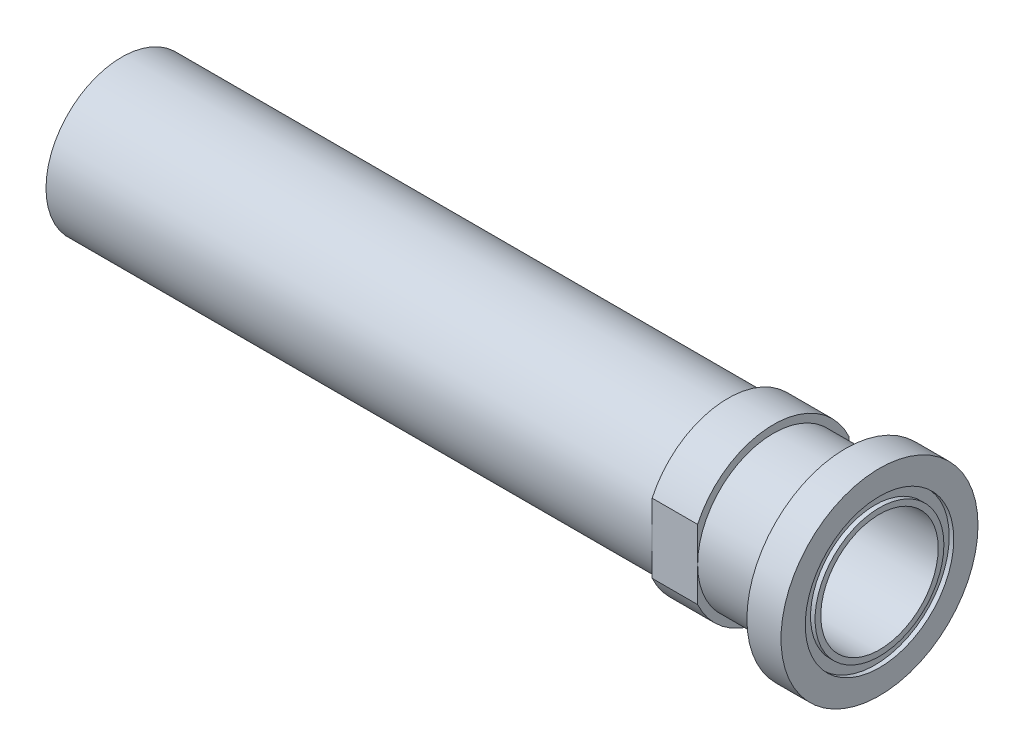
ISO-10303-21;
HEADER;
FILE_DESCRIPTION(('STEP AP214'),'2;1');
FILE_NAME('part.step','',(''),(''),'','','');
FILE_SCHEMA(('AUTOMOTIVE_DESIGN { 1 0 10303 214 1 1 1 1 }'));
ENDSEC;
DATA;
#1=APPLICATION_CONTEXT('core data for automotive mechanical design processes');
#2=APPLICATION_PROTOCOL_DEFINITION('international standard','automotive_design',2000,#1);
#3=PRODUCT_CONTEXT('',#1,'mechanical');
#4=PRODUCT('Part','Part','',(#3));
#5=PRODUCT_RELATED_PRODUCT_CATEGORY('part','',(#4));
#6=PRODUCT_DEFINITION_FORMATION('','',#4);
#7=PRODUCT_DEFINITION_CONTEXT('part definition',#1,'design');
#8=PRODUCT_DEFINITION('design','',#6,#7);
#9=PRODUCT_DEFINITION_SHAPE('','',#8);
#10=(LENGTH_UNIT() NAMED_UNIT(*) SI_UNIT(.MILLI.,.METRE.));
#11=(NAMED_UNIT(*) PLANE_ANGLE_UNIT() SI_UNIT($,.RADIAN.));
#12=(NAMED_UNIT(*) SI_UNIT($,.STERADIAN.) SOLID_ANGLE_UNIT());
#13=UNCERTAINTY_MEASURE_WITH_UNIT(LENGTH_MEASURE(1.E-05),#10,'distance_accuracy_value','');
#14=(GEOMETRIC_REPRESENTATION_CONTEXT(3) GLOBAL_UNCERTAINTY_ASSIGNED_CONTEXT((#13)) GLOBAL_UNIT_ASSIGNED_CONTEXT((#10,
#11,#12)) REPRESENTATION_CONTEXT('',''));
#15=CARTESIAN_POINT('',(0.,0.,0.));
#16=DIRECTION('',(0.,0.,1.));
#17=DIRECTION('',(1.,0.,0.));
#18=AXIS2_PLACEMENT_3D('',#15,#16,#17);
#19=CARTESIAN_POINT('',(-983.,0.,0.));
#20=DIRECTION('',(-1.,0.,0.));
#21=DIRECTION('',(0.,0.,1.));
#22=AXIS2_PLACEMENT_3D('',#19,#20,#21);
#23=CYLINDRICAL_SURFACE('',#22,6.);
#24=CARTESIAN_POINT('',(-988.,0.,0.));
#25=DIRECTION('',(-1.,0.,0.));
#26=DIRECTION('',(0.,0.,1.));
#27=AXIS2_PLACEMENT_3D('',#24,#25,#26);
#28=CIRCLE('',#27,6.);
#29=CARTESIAN_POINT('',(-988.,0.,6.));
#30=VERTEX_POINT('',#29);
#31=EDGE_CURVE('E45',#30,#30,#28,.T.);
#32=ORIENTED_EDGE('',*,*,#31,.T.);
#33=EDGE_LOOP('',(#32));
#34=FACE_BOUND('',#33,.T.);
#35=CARTESIAN_POINT('',(-997.5,0.,0.));
#36=DIRECTION('',(-1.,0.,0.));
#37=DIRECTION('',(0.,0.,1.));
#38=AXIS2_PLACEMENT_3D('',#35,#36,#37);
#39=CIRCLE('',#38,6.);
#40=CARTESIAN_POINT('',(-997.5,0.,6.));
#41=VERTEX_POINT('',#40);
#42=EDGE_CURVE('E480',#41,#41,#39,.T.);
#43=ORIENTED_EDGE('',*,*,#42,.F.);
#44=EDGE_LOOP('',(#43));
#45=FACE_BOUND('',#44,.T.);
#46=ADVANCED_FACE('F37',(#34,#45),#23,.T.);
#47=CARTESIAN_POINT('',(-998.,0.,0.));
#48=DIRECTION('',(-1.,0.,0.));
#49=DIRECTION('',(0.,0.,1.));
#50=AXIS2_PLACEMENT_3D('',#47,#48,#49);
#51=PLANE('',#50);
#52=CARTESIAN_POINT('',(-998.,0.,0.));
#53=DIRECTION('',(-1.,0.,0.));
#54=DIRECTION('',(0.,0.,1.));
#55=AXIS2_PLACEMENT_3D('',#52,#53,#54);
#56=CIRCLE('',#55,4.20000000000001);
#57=CARTESIAN_POINT('',(-998.,0.,4.20000000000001));
#58=VERTEX_POINT('',#57);
#59=EDGE_CURVE('E488',#58,#58,#56,.T.);
#60=ORIENTED_EDGE('',*,*,#59,.F.);
#61=EDGE_LOOP('',(#60));
#62=FACE_BOUND('',#61,.T.);
#63=CARTESIAN_POINT('',(-998.,0.,0.));
#64=DIRECTION('',(-1.,0.,0.));
#65=DIRECTION('',(0.,0.,1.));
#66=AXIS2_PLACEMENT_3D('',#63,#64,#65);
#67=CIRCLE('',#66,4.8);
#68=CARTESIAN_POINT('',(-998.,0.,4.8));
#69=VERTEX_POINT('',#68);
#70=EDGE_CURVE('E477',#69,#69,#67,.T.);
#71=ORIENTED_EDGE('',*,*,#70,.T.);
#72=EDGE_LOOP('',(#71));
#73=FACE_BOUND('',#72,.T.);
#74=ADVANCED_FACE('F185',(#62,#73),#51,.T.);
#75=CARTESIAN_POINT('',(-900.,0.,0.));
#76=DIRECTION('',(-1.,0.,0.));
#77=DIRECTION('',(0.,0.,1.));
#78=AXIS2_PLACEMENT_3D('',#75,#76,#77);
#79=CYLINDRICAL_SURFACE('',#78,2.5);
#80=CARTESIAN_POINT('',(-900.,0.,0.));
#81=DIRECTION('',(-1.,0.,0.));
#82=DIRECTION('',(0.,0.,1.));
#83=AXIS2_PLACEMENT_3D('',#80,#81,#82);
#84=CIRCLE('',#83,2.5);
#85=CARTESIAN_POINT('',(-900.,0.,2.5));
#86=VERTEX_POINT('',#85);
#87=EDGE_CURVE('E287',#86,#86,#84,.T.);
#88=ORIENTED_EDGE('',*,*,#87,.F.);
#89=EDGE_LOOP('',(#88));
#90=FACE_BOUND('',#89,.T.);
#91=CARTESIAN_POINT('',(-992.,0.,0.));
#92=DIRECTION('',(-1.,0.,0.));
#93=DIRECTION('',(0.,0.,1.));
#94=AXIS2_PLACEMENT_3D('',#91,#92,#93);
#95=CIRCLE('',#94,2.5);
#96=CARTESIAN_POINT('',(-992.,0.,2.5));
#97=VERTEX_POINT('',#96);
#98=EDGE_CURVE('E160',#97,#97,#95,.F.);
#99=ORIENTED_EDGE('',*,*,#98,.F.);
#100=EDGE_LOOP('',(#99));
#101=FACE_BOUND('',#100,.T.);
#102=ADVANCED_FACE('F190',(#90,#101),#79,.F.);
#103=CARTESIAN_POINT('',(-140.,0.,-100.));
#104=DIRECTION('',(-1.,0.,0.));
#105=DIRECTION('',(0.,0.,1.));
#106=AXIS2_PLACEMENT_3D('',#103,#104,#105);
#107=PLANE('',#106);
#108=CARTESIAN_POINT('',(-140.,0.,0.));
#109=DIRECTION('',(1.,0.,0.));
#110=DIRECTION('',(0.,0.,-1.));
#111=AXIS2_PLACEMENT_3D('',#108,#109,#110);
#112=CIRCLE('',#111,110.);
#113=CARTESIAN_POINT('',(-140.,-45.8257569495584,100.));
#114=VERTEX_POINT('',#113);
#115=CARTESIAN_POINT('',(-140.,-45.8257569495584,-100.));
#116=VERTEX_POINT('',#115);
#117=EDGE_CURVE('E110',#114,#116,#112,.T.);
#118=ORIENTED_EDGE('',*,*,#117,.T.);
#119=DIRECTION('',(0.,-1.,0.));
#120=VECTOR('',#119,1.);
#121=CARTESIAN_POINT('',(-140.,-83.0662386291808,-100.));
#122=LINE('',#121,#120);
#123=CARTESIAN_POINT('',(-140.,0.,-100.));
#124=VERTEX_POINT('',#123);
#125=EDGE_CURVE('E52',#124,#116,#122,.T.);
#126=ORIENTED_EDGE('',*,*,#125,.F.);
#127=CARTESIAN_POINT('',(-140.,0.,0.));
#128=DIRECTION('',(1.,0.,0.));
#129=DIRECTION('',(0.,0.,-1.));
#130=AXIS2_PLACEMENT_3D('',#127,#128,#129);
#131=CIRCLE('',#130,100.);
#132=CARTESIAN_POINT('',(-140.,0.,100.));
#133=VERTEX_POINT('',#132);
#134=EDGE_CURVE('E111',#133,#124,#131,.T.);
#135=ORIENTED_EDGE('',*,*,#134,.F.);
#136=DIRECTION('',(0.,1.,0.));
#137=VECTOR('',#136,1.);
#138=CARTESIAN_POINT('',(-140.,-83.0662386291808,100.));
#139=LINE('',#138,#137);
#140=EDGE_CURVE('E299',#114,#133,#139,.T.);
#141=ORIENTED_EDGE('',*,*,#140,.F.);
#142=EDGE_LOOP('',(#118,#126,#135,#141));
#143=FACE_BOUND('',#142,.T.);
#144=ADVANCED_FACE('F207',(#143),#107,.F.);
#145=CARTESIAN_POINT('',(-200.,0.,0.));
#146=DIRECTION('',(-1.,0.,0.));
#147=DIRECTION('',(0.,0.,1.));
#148=AXIS2_PLACEMENT_3D('',#145,#146,#147);
#149=PLANE('',#148);
#150=DIRECTION('',(0.,-1.,0.));
#151=VECTOR('',#150,1.);
#152=CARTESIAN_POINT('',(-200.,-83.0662386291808,-100.));
#153=LINE('',#152,#151);
#154=CARTESIAN_POINT('',(-200.,0.,-100.));
#155=VERTEX_POINT('',#154);
#156=CARTESIAN_POINT('',(-200.,-45.8257569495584,-100.));
#157=VERTEX_POINT('',#156);
#158=EDGE_CURVE('E105',#155,#157,#153,.T.);
#159=ORIENTED_EDGE('',*,*,#158,.T.);
#160=CARTESIAN_POINT('',(-200.,0.,0.));
#161=DIRECTION('',(-1.,0.,0.));
#162=DIRECTION('',(0.,0.,1.));
#163=AXIS2_PLACEMENT_3D('',#160,#161,#162);
#164=CIRCLE('',#163,110.);
#165=CARTESIAN_POINT('',(-200.,-45.8257569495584,100.));
#166=VERTEX_POINT('',#165);
#167=EDGE_CURVE('E121',#157,#166,#164,.T.);
#168=ORIENTED_EDGE('',*,*,#167,.T.);
#169=DIRECTION('',(0.,1.,0.));
#170=VECTOR('',#169,1.);
#171=CARTESIAN_POINT('',(-200.,-83.0662386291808,100.));
#172=LINE('',#171,#170);
#173=CARTESIAN_POINT('',(-200.,0.,100.));
#174=VERTEX_POINT('',#173);
#175=EDGE_CURVE('E298',#166,#174,#172,.T.);
#176=ORIENTED_EDGE('',*,*,#175,.T.);
#177=CARTESIAN_POINT('',(-200.,0.,0.));
#178=DIRECTION('',(-1.,0.,0.));
#179=DIRECTION('',(0.,0.,1.));
#180=AXIS2_PLACEMENT_3D('',#177,#178,#179);
#181=CIRCLE('',#180,100.);
#182=EDGE_CURVE('E122',#155,#174,#181,.T.);
#183=ORIENTED_EDGE('',*,*,#182,.F.);
#184=EDGE_LOOP('',(#159,#168,#176,#183));
#185=FACE_BOUND('',#184,.T.);
#186=ADVANCED_FACE('F241',(#185),#149,.T.);
#187=CARTESIAN_POINT('',(-45.,0.,0.));
#188=DIRECTION('',(-1.,0.,0.));
#189=DIRECTION('',(0.,0.,1.));
#190=AXIS2_PLACEMENT_3D('',#187,#188,#189);
#191=CYLINDRICAL_SURFACE('',#190,110.);
#192=DIRECTION('',(-1.,0.,0.));
#193=VECTOR('',#192,1.);
#194=CARTESIAN_POINT('',(-45.,45.8257569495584,-100.));
#195=LINE('',#194,#193);
#196=CARTESIAN_POINT('',(-200.,45.8257569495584,-100.));
#197=VERTEX_POINT('',#196);
#198=CARTESIAN_POINT('',(-140.,45.8257569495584,-100.));
#199=VERTEX_POINT('',#198);
#200=EDGE_CURVE('E90',#197,#199,#195,.F.);
#201=ORIENTED_EDGE('',*,*,#200,.F.);
#202=CARTESIAN_POINT('',(-200.,45.8257569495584,100.));
#203=VERTEX_POINT('',#202);
#204=EDGE_CURVE('E125',#203,#197,#164,.T.);
#205=ORIENTED_EDGE('',*,*,#204,.F.);
#206=DIRECTION('',(-1.,0.,0.));
#207=VECTOR('',#206,1.);
#208=CARTESIAN_POINT('',(-45.,45.8257569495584,100.));
#209=LINE('',#208,#207);
#210=CARTESIAN_POINT('',(-140.,45.8257569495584,100.));
#211=VERTEX_POINT('',#210);
#212=EDGE_CURVE('E109',#211,#203,#209,.T.);
#213=ORIENTED_EDGE('',*,*,#212,.F.);
#214=EDGE_CURVE('E60',#199,#211,#112,.T.);
#215=ORIENTED_EDGE('',*,*,#214,.F.);
#216=EDGE_LOOP('',(#201,#205,#213,#215));
#217=FACE_BOUND('',#216,.T.);
#218=ADVANCED_FACE('F108',(#217),#191,.T.);
#219=CARTESIAN_POINT('',(-1000.,0.,0.));
#220=DIRECTION('',(1.,0.,0.));
#221=DIRECTION('',(0.,0.,-1.));
#222=AXIS2_PLACEMENT_3D('',#219,#220,#221);
#223=CYLINDRICAL_SURFACE('',#222,130.);
#224=CARTESIAN_POINT('',(0.,0.,0.));
#225=DIRECTION('',(1.,0.,0.));
#226=DIRECTION('',(0.,0.,-1.));
#227=AXIS2_PLACEMENT_3D('',#224,#225,#226);
#228=CIRCLE('',#227,130.);
#229=CARTESIAN_POINT('',(0.,0.,-130.));
#230=VERTEX_POINT('',#229);
#231=EDGE_CURVE('E142',#230,#230,#228,.T.);
#232=ORIENTED_EDGE('',*,*,#231,.F.);
#233=EDGE_LOOP('',(#232));
#234=FACE_BOUND('',#233,.T.);
#235=CARTESIAN_POINT('',(-45.,0.,0.));
#236=DIRECTION('',(-1.,0.,0.));
#237=DIRECTION('',(0.,0.,1.));
#238=AXIS2_PLACEMENT_3D('',#235,#236,#237);
#239=CIRCLE('',#238,130.);
#240=CARTESIAN_POINT('',(-45.,0.,130.));
#241=VERTEX_POINT('',#240);
#242=EDGE_CURVE('E137',#241,#241,#239,.T.);
#243=ORIENTED_EDGE('',*,*,#242,.F.);
#244=EDGE_LOOP('',(#243));
#245=FACE_BOUND('',#244,.T.);
#246=ADVANCED_FACE('F267',(#234,#245),#223,.T.);
#247=CARTESIAN_POINT('',(0.,0.,0.));
#248=DIRECTION('',(1.,0.,0.));
#249=DIRECTION('',(0.,0.,-1.));
#250=AXIS2_PLACEMENT_3D('',#247,#248,#249);
#251=PLANE('',#250);
#252=CARTESIAN_POINT('',(0.,0.,0.));
#253=DIRECTION('',(1.,0.,0.));
#254=DIRECTION('',(0.,0.,-1.));
#255=AXIS2_PLACEMENT_3D('',#252,#253,#254);
#256=CIRCLE('',#255,98.);
#257=CARTESIAN_POINT('',(0.,0.,-98.));
#258=VERTEX_POINT('',#257);
#259=EDGE_CURVE('E131',#258,#258,#256,.T.);
#260=ORIENTED_EDGE('',*,*,#259,.F.);
#261=EDGE_LOOP('',(#260));
#262=FACE_BOUND('',#261,.T.);
#263=ORIENTED_EDGE('',*,*,#231,.T.);
#264=EDGE_LOOP('',(#263));
#265=FACE_BOUND('',#264,.T.);
#266=ADVANCED_FACE('F260',(#262,#265),#251,.T.);
#267=CARTESIAN_POINT('',(-45.,0.,0.));
#268=DIRECTION('',(-1.,0.,0.));
#269=DIRECTION('',(0.,0.,1.));
#270=AXIS2_PLACEMENT_3D('',#267,#268,#269);
#271=PLANE('',#270);
#272=CARTESIAN_POINT('',(-45.,0.,0.));
#273=DIRECTION('',(-1.,0.,0.));
#274=DIRECTION('',(0.,0.,1.));
#275=AXIS2_PLACEMENT_3D('',#272,#273,#274);
#276=CIRCLE('',#275,105.);
#277=CARTESIAN_POINT('',(-45.,0.,105.));
#278=VERTEX_POINT('',#277);
#279=EDGE_CURVE('E98',#278,#278,#276,.F.);
#280=ORIENTED_EDGE('',*,*,#279,.T.);
#281=EDGE_LOOP('',(#280));
#282=FACE_BOUND('',#281,.T.);
#283=ORIENTED_EDGE('',*,*,#242,.T.);
#284=EDGE_LOOP('',(#283));
#285=FACE_BOUND('',#284,.T.);
#286=ADVANCED_FACE('F253',(#282,#285),#271,.T.);
#287=CARTESIAN_POINT('',(-6.,0.,0.));
#288=DIRECTION('',(1.,0.,0.));
#289=DIRECTION('',(0.,0.,-1.));
#290=AXIS2_PLACEMENT_3D('',#287,#288,#289);
#291=CYLINDRICAL_SURFACE('',#290,98.);
#292=CARTESIAN_POINT('',(-6.,0.,0.));
#293=DIRECTION('',(1.,0.,0.));
#294=DIRECTION('',(0.,0.,-1.));
#295=AXIS2_PLACEMENT_3D('',#292,#293,#294);
#296=CIRCLE('',#295,98.);
#297=CARTESIAN_POINT('',(-6.,0.,-98.));
#298=VERTEX_POINT('',#297);
#299=EDGE_CURVE('E134',#298,#298,#296,.T.);
#300=ORIENTED_EDGE('',*,*,#299,.F.);
#301=EDGE_LOOP('',(#300));
#302=FACE_BOUND('',#301,.T.);
#303=ORIENTED_EDGE('',*,*,#259,.T.);
#304=EDGE_LOOP('',(#303));
#305=FACE_BOUND('',#304,.T.);
#306=ADVANCED_FACE('F249',(#302,#305),#291,.F.);
#307=CARTESIAN_POINT('',(-6.,0.,0.));
#308=DIRECTION('',(1.,0.,0.));
#309=DIRECTION('',(0.,0.,-1.));
#310=AXIS2_PLACEMENT_3D('',#307,#308,#309);
#311=PLANE('',#310);
#312=CARTESIAN_POINT('',(-6.,0.,0.));
#313=DIRECTION('',(1.,0.,0.));
#314=DIRECTION('',(0.,0.,-1.));
#315=AXIS2_PLACEMENT_3D('',#312,#313,#314);
#316=CIRCLE('',#315,85.);
#317=CARTESIAN_POINT('',(-6.,0.,-85.));
#318=VERTEX_POINT('',#317);
#319=EDGE_CURVE('E128',#318,#318,#316,.T.);
#320=ORIENTED_EDGE('',*,*,#319,.F.);
#321=EDGE_LOOP('',(#320));
#322=FACE_BOUND('',#321,.T.);
#323=ORIENTED_EDGE('',*,*,#299,.T.);
#324=EDGE_LOOP('',(#323));
#325=FACE_BOUND('',#324,.T.);
#326=ADVANCED_FACE('F245',(#322,#325),#311,.T.);
#327=CARTESIAN_POINT('',(-6.,0.,0.));
#328=DIRECTION('',(1.,0.,0.));
#329=DIRECTION('',(0.,0.,-1.));
#330=AXIS2_PLACEMENT_3D('',#327,#328,#329);
#331=CYLINDRICAL_SURFACE('',#330,85.);
#332=ORIENTED_EDGE('',*,*,#319,.T.);
#333=EDGE_LOOP('',(#332));
#334=FACE_BOUND('',#333,.T.);
#335=CARTESIAN_POINT('',(0.,0.,0.));
#336=DIRECTION('',(1.,0.,0.));
#337=DIRECTION('',(0.,0.,-1.));
#338=AXIS2_PLACEMENT_3D('',#335,#336,#337);
#339=CIRCLE('',#338,85.);
#340=CARTESIAN_POINT('',(0.,0.,-85.));
#341=VERTEX_POINT('',#340);
#342=EDGE_CURVE('E127',#341,#341,#339,.T.);
#343=ORIENTED_EDGE('',*,*,#342,.F.);
#344=EDGE_LOOP('',(#343));
#345=FACE_BOUND('',#344,.T.);
#346=ADVANCED_FACE('F242',(#334,#345),#331,.T.);
#347=CARTESIAN_POINT('',(0.,0.,0.));
#348=DIRECTION('',(1.,0.,0.));
#349=DIRECTION('',(0.,0.,-1.));
#350=AXIS2_PLACEMENT_3D('',#347,#348,#349);
#351=CIRCLE('',#350,77.5);
#352=CARTESIAN_POINT('',(0.,0.,-77.5));
#353=VERTEX_POINT('',#352);
#354=EDGE_CURVE('E285',#353,#353,#351,.T.);
#355=ORIENTED_EDGE('',*,*,#354,.F.);
#356=EDGE_LOOP('',(#355));
#357=FACE_BOUND('',#356,.T.);
#358=ORIENTED_EDGE('',*,*,#342,.T.);
#359=EDGE_LOOP('',(#358));
#360=FACE_BOUND('',#359,.T.);
#361=ADVANCED_FACE('F232',(#357,#360),#251,.T.);
#362=EDGE_CURVE('E103',#124,#133,#131,.T.);
#363=ORIENTED_EDGE('',*,*,#362,.F.);
#364=EDGE_CURVE('E92',#199,#124,#122,.T.);
#365=ORIENTED_EDGE('',*,*,#364,.F.);
#366=ORIENTED_EDGE('',*,*,#214,.T.);
#367=EDGE_CURVE('E300',#133,#211,#139,.T.);
#368=ORIENTED_EDGE('',*,*,#367,.F.);
#369=EDGE_LOOP('',(#363,#365,#366,#368));
#370=FACE_BOUND('',#369,.T.);
#371=ADVANCED_FACE('F102',(#370),#107,.F.);
#372=CARTESIAN_POINT('',(56.3397715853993,0.,0.));
#373=DIRECTION('',(1.,0.,0.));
#374=DIRECTION('',(0.,0.,-1.));
#375=AXIS2_PLACEMENT_3D('',#372,#373,#374);
#376=CYLINDRICAL_SURFACE('',#375,100.);
#377=CARTESIAN_POINT('',(-50.,0.,0.));
#378=DIRECTION('',(-1.,0.,0.));
#379=DIRECTION('',(0.,0.,1.));
#380=AXIS2_PLACEMENT_3D('',#377,#378,#379);
#381=CIRCLE('',#380,100.);
#382=CARTESIAN_POINT('',(-50.,0.,100.));
#383=VERTEX_POINT('',#382);
#384=EDGE_CURVE('E151',#383,#383,#381,.T.);
#385=ORIENTED_EDGE('',*,*,#384,.T.);
#386=EDGE_LOOP('',(#385));
#387=FACE_BOUND('',#386,.T.);
#388=ORIENTED_EDGE('',*,*,#134,.T.);
#389=ORIENTED_EDGE('',*,*,#362,.T.);
#390=EDGE_LOOP('',(#388,#389));
#391=FACE_BOUND('',#390,.T.);
#392=ADVANCED_FACE('F225',(#387,#391),#376,.T.);
#393=CARTESIAN_POINT('',(-1000.,0.,0.));
#394=DIRECTION('',(1.,0.,0.));
#395=DIRECTION('',(0.,0.,-1.));
#396=AXIS2_PLACEMENT_3D('',#393,#394,#395);
#397=PLANE('',#396);
#398=CARTESIAN_POINT('',(-1000.,0.,0.));
#399=DIRECTION('',(-1.,0.,0.));
#400=DIRECTION('',(0.,0.,1.));
#401=AXIS2_PLACEMENT_3D('',#398,#399,#400);
#402=CIRCLE('',#401,90.);
#403=CARTESIAN_POINT('',(-1000.,0.,90.));
#404=VERTEX_POINT('',#403);
#405=EDGE_CURVE('E162',#404,#404,#402,.T.);
#406=ORIENTED_EDGE('',*,*,#405,.F.);
#407=EDGE_LOOP('',(#406));
#408=FACE_BOUND('',#407,.T.);
#409=CARTESIAN_POINT('',(-1000.,0.,0.));
#410=DIRECTION('',(-1.,0.,0.));
#411=DIRECTION('',(0.,0.,1.));
#412=AXIS2_PLACEMENT_3D('',#409,#410,#411);
#413=CIRCLE('',#412,100.);
#414=CARTESIAN_POINT('',(-1000.,0.,100.));
#415=VERTEX_POINT('',#414);
#416=EDGE_CURVE('E114',#415,#415,#413,.T.);
#417=ORIENTED_EDGE('',*,*,#416,.T.);
#418=EDGE_LOOP('',(#417));
#419=FACE_BOUND('',#418,.T.);
#420=ADVANCED_FACE('F228',(#408,#419),#397,.F.);
#421=CARTESIAN_POINT('',(-200.,0.,0.));
#422=DIRECTION('',(-1.,0.,0.));
#423=DIRECTION('',(0.,0.,1.));
#424=AXIS2_PLACEMENT_3D('',#421,#422,#423);
#425=CYLINDRICAL_SURFACE('',#424,100.);
#426=EDGE_CURVE('E118',#174,#155,#181,.T.);
#427=ORIENTED_EDGE('',*,*,#426,.T.);
#428=ORIENTED_EDGE('',*,*,#182,.T.);
#429=EDGE_LOOP('',(#427,#428));
#430=FACE_BOUND('',#429,.T.);
#431=ORIENTED_EDGE('',*,*,#416,.F.);
#432=EDGE_LOOP('',(#431));
#433=FACE_BOUND('',#432,.T.);
#434=ADVANCED_FACE('F233',(#430,#433),#425,.T.);
#435=EDGE_CURVE('E94',#197,#155,#153,.T.);
#436=ORIENTED_EDGE('',*,*,#435,.T.);
#437=ORIENTED_EDGE('',*,*,#426,.F.);
#438=EDGE_CURVE('E296',#174,#203,#172,.T.);
#439=ORIENTED_EDGE('',*,*,#438,.T.);
#440=ORIENTED_EDGE('',*,*,#204,.T.);
#441=EDGE_LOOP('',(#436,#437,#439,#440));
#442=FACE_BOUND('',#441,.T.);
#443=ADVANCED_FACE('F236',(#442),#149,.T.);
#444=DIRECTION('',(-1.,0.,0.));
#445=VECTOR('',#444,1.);
#446=CARTESIAN_POINT('',(-45.,-45.8257569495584,-100.));
#447=LINE('',#446,#445);
#448=EDGE_CURVE('E99',#116,#157,#447,.T.);
#449=ORIENTED_EDGE('',*,*,#448,.F.);
#450=ORIENTED_EDGE('',*,*,#117,.F.);
#451=DIRECTION('',(-1.,0.,0.));
#452=VECTOR('',#451,1.);
#453=CARTESIAN_POINT('',(-45.,-45.8257569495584,100.));
#454=LINE('',#453,#452);
#455=EDGE_CURVE('E146',#166,#114,#454,.F.);
#456=ORIENTED_EDGE('',*,*,#455,.F.);
#457=ORIENTED_EDGE('',*,*,#167,.F.);
#458=EDGE_LOOP('',(#449,#450,#456,#457));
#459=FACE_BOUND('',#458,.T.);
#460=ADVANCED_FACE('F223',(#459),#191,.T.);
#461=CARTESIAN_POINT('',(-200.,-83.0662386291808,100.));
#462=DIRECTION('',(0.,0.,-1.));
#463=DIRECTION('',(-1.,0.,0.));
#464=AXIS2_PLACEMENT_3D('',#461,#462,#463);
#465=PLANE('',#464);
#466=ORIENTED_EDGE('',*,*,#455,.T.);
#467=ORIENTED_EDGE('',*,*,#140,.T.);
#468=ORIENTED_EDGE('',*,*,#367,.T.);
#469=ORIENTED_EDGE('',*,*,#212,.T.);
#470=ORIENTED_EDGE('',*,*,#438,.F.);
#471=ORIENTED_EDGE('',*,*,#175,.F.);
#472=EDGE_LOOP('',(#466,#467,#468,#469,#470,#471));
#473=FACE_BOUND('',#472,.T.);
#474=ADVANCED_FACE('F220',(#473),#465,.F.);
#475=CARTESIAN_POINT('',(-200.,-83.0662386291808,-100.));
#476=DIRECTION('',(0.,0.,1.));
#477=DIRECTION('',(1.,0.,0.));
#478=AXIS2_PLACEMENT_3D('',#475,#476,#477);
#479=PLANE('',#478);
#480=ORIENTED_EDGE('',*,*,#200,.T.);
#481=ORIENTED_EDGE('',*,*,#364,.T.);
#482=ORIENTED_EDGE('',*,*,#125,.T.);
#483=ORIENTED_EDGE('',*,*,#448,.T.);
#484=ORIENTED_EDGE('',*,*,#158,.F.);
#485=ORIENTED_EDGE('',*,*,#435,.F.);
#486=EDGE_LOOP('',(#480,#481,#482,#483,#484,#485));
#487=FACE_BOUND('',#486,.T.);
#488=ADVANCED_FACE('F91',(#487),#479,.F.);
#489=CARTESIAN_POINT('',(-50.,0.,0.));
#490=DIRECTION('',(-1.,0.,0.));
#491=DIRECTION('',(0.,0.,1.));
#492=AXIS2_PLACEMENT_3D('',#489,#490,#491);
#493=TOROIDAL_SURFACE('',#492,105.,5.);
#494=ORIENTED_EDGE('',*,*,#384,.F.);
#495=EDGE_LOOP('',(#494));
#496=FACE_BOUND('',#495,.T.);
#497=ORIENTED_EDGE('',*,*,#279,.F.);
#498=EDGE_LOOP('',(#497));
#499=FACE_BOUND('',#498,.T.);
#500=ADVANCED_FACE('F216',(#496,#499),#493,.F.);
#501=CARTESIAN_POINT('',(-900.,0.,0.));
#502=DIRECTION('',(1.,0.,0.));
#503=DIRECTION('',(0.,0.,-1.));
#504=AXIS2_PLACEMENT_3D('',#501,#502,#503);
#505=CYLINDRICAL_SURFACE('',#504,77.5);
#506=CARTESIAN_POINT('',(-885.,0.,0.));
#507=DIRECTION('',(1.,0.,0.));
#508=DIRECTION('',(0.,0.,-1.));
#509=AXIS2_PLACEMENT_3D('',#506,#507,#508);
#510=CIRCLE('',#509,77.5);
#511=CARTESIAN_POINT('',(-885.,0.,-77.5));
#512=VERTEX_POINT('',#511);
#513=EDGE_CURVE('E157',#512,#512,#510,.F.);
#514=ORIENTED_EDGE('',*,*,#513,.T.);
#515=EDGE_LOOP('',(#514));
#516=FACE_BOUND('',#515,.T.);
#517=ORIENTED_EDGE('',*,*,#354,.T.);
#518=EDGE_LOOP('',(#517));
#519=FACE_BOUND('',#518,.T.);
#520=ADVANCED_FACE('F212',(#516,#519),#505,.F.);
#521=CARTESIAN_POINT('',(-900.,0.,0.));
#522=DIRECTION('',(1.,0.,0.));
#523=DIRECTION('',(0.,0.,-1.));
#524=AXIS2_PLACEMENT_3D('',#521,#522,#523);
#525=PLANE('',#524);
#526=ORIENTED_EDGE('',*,*,#87,.T.);
#527=EDGE_LOOP('',(#526));
#528=FACE_BOUND('',#527,.T.);
#529=CARTESIAN_POINT('',(-900.,0.,0.));
#530=DIRECTION('',(1.,0.,0.));
#531=DIRECTION('',(0.,0.,-1.));
#532=AXIS2_PLACEMENT_3D('',#529,#530,#531);
#533=CIRCLE('',#532,62.5);
#534=CARTESIAN_POINT('',(-900.,0.,-62.5));
#535=VERTEX_POINT('',#534);
#536=EDGE_CURVE('E154',#535,#535,#533,.T.);
#537=ORIENTED_EDGE('',*,*,#536,.T.);
#538=EDGE_LOOP('',(#537));
#539=FACE_BOUND('',#538,.T.);
#540=ADVANCED_FACE('F209',(#528,#539),#525,.T.);
#541=CARTESIAN_POINT('',(-885.,0.,0.));
#542=DIRECTION('',(1.,0.,0.));
#543=DIRECTION('',(0.,0.,-1.));
#544=AXIS2_PLACEMENT_3D('',#541,#542,#543);
#545=TOROIDAL_SURFACE('',#544,62.5,15.);
#546=ORIENTED_EDGE('',*,*,#513,.F.);
#547=EDGE_LOOP('',(#546));
#548=FACE_BOUND('',#547,.T.);
#549=ORIENTED_EDGE('',*,*,#536,.F.);
#550=EDGE_LOOP('',(#549));
#551=FACE_BOUND('',#550,.T.);
#552=ADVANCED_FACE('F203',(#548,#551),#545,.F.);
#553=CARTESIAN_POINT('',(-983.,0.,0.));
#554=DIRECTION('',(-1.,0.,0.));
#555=DIRECTION('',(0.,0.,1.));
#556=AXIS2_PLACEMENT_3D('',#553,#554,#555);
#557=CYLINDRICAL_SURFACE('',#556,90.);
#558=CARTESIAN_POINT('',(-983.,0.,0.));
#559=DIRECTION('',(-1.,0.,0.));
#560=DIRECTION('',(0.,0.,1.));
#561=AXIS2_PLACEMENT_3D('',#558,#559,#560);
#562=CIRCLE('',#561,90.);
#563=CARTESIAN_POINT('',(-983.,0.,90.));
#564=VERTEX_POINT('',#563);
#565=EDGE_CURVE('E290',#564,#564,#562,.T.);
#566=ORIENTED_EDGE('',*,*,#565,.F.);
#567=EDGE_LOOP('',(#566));
#568=FACE_BOUND('',#567,.T.);
#569=ORIENTED_EDGE('',*,*,#405,.T.);
#570=EDGE_LOOP('',(#569));
#571=FACE_BOUND('',#570,.T.);
#572=ADVANCED_FACE('F199',(#568,#571),#557,.F.);
#573=CARTESIAN_POINT('',(-983.,0.,0.));
#574=DIRECTION('',(-1.,0.,0.));
#575=DIRECTION('',(0.,0.,1.));
#576=AXIS2_PLACEMENT_3D('',#573,#574,#575);
#577=PLANE('',#576);
#578=CARTESIAN_POINT('',(-983.,0.,0.));
#579=DIRECTION('',(-1.,0.,0.));
#580=DIRECTION('',(0.,0.,1.));
#581=AXIS2_PLACEMENT_3D('',#578,#579,#580);
#582=CIRCLE('',#581,11.);
#583=CARTESIAN_POINT('',(-983.,0.,11.));
#584=VERTEX_POINT('',#583);
#585=EDGE_CURVE('E11',#584,#584,#582,.F.);
#586=ORIENTED_EDGE('',*,*,#585,.T.);
#587=EDGE_LOOP('',(#586));
#588=FACE_BOUND('',#587,.T.);
#589=ORIENTED_EDGE('',*,*,#565,.T.);
#590=EDGE_LOOP('',(#589));
#591=FACE_BOUND('',#590,.T.);
#592=ADVANCED_FACE('F195',(#588,#591),#577,.T.);
#593=CARTESIAN_POINT('',(-992.,0.,-3.));
#594=DIRECTION('',(-1.,0.,0.));
#595=DIRECTION('',(0.,0.,1.));
#596=AXIS2_PLACEMENT_3D('',#593,#594,#595);
#597=PLANE('',#596);
#598=CARTESIAN_POINT('',(-992.,0.,0.));
#599=DIRECTION('',(-1.,0.,0.));
#600=DIRECTION('',(0.,0.,1.));
#601=AXIS2_PLACEMENT_3D('',#598,#599,#600);
#602=CIRCLE('',#601,3.);
#603=CARTESIAN_POINT('',(-992.,0.,3.));
#604=VERTEX_POINT('',#603);
#605=EDGE_CURVE('E163',#604,#604,#602,.T.);
#606=ORIENTED_EDGE('',*,*,#605,.T.);
#607=EDGE_LOOP('',(#606));
#608=FACE_BOUND('',#607,.T.);
#609=ORIENTED_EDGE('',*,*,#98,.T.);
#610=EDGE_LOOP('',(#609));
#611=FACE_BOUND('',#610,.T.);
#612=ADVANCED_FACE('F198',(#608,#611),#597,.T.);
#613=CARTESIAN_POINT('',(-1000.,0.,0.));
#614=DIRECTION('',(-1.,0.,0.));
#615=DIRECTION('',(0.,0.,1.));
#616=AXIS2_PLACEMENT_3D('',#613,#614,#615);
#617=CYLINDRICAL_SURFACE('',#616,3.);
#618=CARTESIAN_POINT('',(-994.873893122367,0.,0.));
#619=DIRECTION('',(-1.,0.,0.));
#620=DIRECTION('',(0.,0.,1.));
#621=AXIS2_PLACEMENT_3D('',#618,#619,#620);
#622=CIRCLE('',#621,3.);
#623=CARTESIAN_POINT('',(-994.873893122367,0.,3.));
#624=VERTEX_POINT('',#623);
#625=EDGE_CURVE('E485',#624,#624,#622,.T.);
#626=ORIENTED_EDGE('',*,*,#625,.T.);
#627=EDGE_LOOP('',(#626));
#628=FACE_BOUND('',#627,.T.);
#629=ORIENTED_EDGE('',*,*,#605,.F.);
#630=EDGE_LOOP('',(#629));
#631=FACE_BOUND('',#630,.T.);
#632=ADVANCED_FACE('F180',(#628,#631),#617,.F.);
#633=CARTESIAN_POINT('',(-994.873893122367,0.,0.));
#634=DIRECTION('',(-1.,0.,0.));
#635=DIRECTION('',(0.,0.,1.));
#636=AXIS2_PLACEMENT_3D('',#633,#634,#635);
#637=CONICAL_SURFACE('',#636,3.,0.366519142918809);
#638=ORIENTED_EDGE('',*,*,#59,.T.);
#639=EDGE_LOOP('',(#638));
#640=FACE_BOUND('',#639,.T.);
#641=ORIENTED_EDGE('',*,*,#625,.F.);
#642=EDGE_LOOP('',(#641));
#643=FACE_BOUND('',#642,.T.);
#644=ADVANCED_FACE('F171',(#640,#643),#637,.F.);
#645=CARTESIAN_POINT('',(-988.,0.,0.));
#646=DIRECTION('',(-1.,0.,0.));
#647=DIRECTION('',(0.,0.,1.));
#648=AXIS2_PLACEMENT_3D('',#645,#646,#647);
#649=TOROIDAL_SURFACE('',#648,11.,5.);
#650=ORIENTED_EDGE('',*,*,#585,.F.);
#651=EDGE_LOOP('',(#650));
#652=FACE_BOUND('',#651,.T.);
#653=ORIENTED_EDGE('',*,*,#31,.F.);
#654=EDGE_LOOP('',(#653));
#655=FACE_BOUND('',#654,.T.);
#656=ADVANCED_FACE('F39',(#652,#655),#649,.F.);
#657=CARTESIAN_POINT('',(-997.5,0.,0.));
#658=DIRECTION('',(-1.,0.,0.));
#659=DIRECTION('',(0.,0.,1.));
#660=AXIS2_PLACEMENT_3D('',#657,#658,#659);
#661=PLANE('',#660);
#662=CARTESIAN_POINT('',(-997.5,0.,0.));
#663=DIRECTION('',(-1.,0.,0.));
#664=DIRECTION('',(0.,0.,1.));
#665=AXIS2_PLACEMENT_3D('',#662,#663,#664);
#666=CIRCLE('',#665,4.8);
#667=CARTESIAN_POINT('',(-997.5,0.,4.8));
#668=VERTEX_POINT('',#667);
#669=EDGE_CURVE('E474',#668,#668,#666,.T.);
#670=ORIENTED_EDGE('',*,*,#669,.F.);
#671=EDGE_LOOP('',(#670));
#672=FACE_BOUND('',#671,.T.);
#673=ORIENTED_EDGE('',*,*,#42,.T.);
#674=EDGE_LOOP('',(#673));
#675=FACE_BOUND('',#674,.T.);
#676=ADVANCED_FACE('F170',(#672,#675),#661,.T.);
#677=CARTESIAN_POINT('',(-997.5,0.,0.));
#678=DIRECTION('',(-1.,0.,0.));
#679=DIRECTION('',(0.,0.,1.));
#680=AXIS2_PLACEMENT_3D('',#677,#678,#679);
#681=CYLINDRICAL_SURFACE('',#680,4.8);
#682=ORIENTED_EDGE('',*,*,#669,.T.);
#683=EDGE_LOOP('',(#682));
#684=FACE_BOUND('',#683,.T.);
#685=ORIENTED_EDGE('',*,*,#70,.F.);
#686=EDGE_LOOP('',(#685));
#687=FACE_BOUND('',#686,.T.);
#688=ADVANCED_FACE('F177',(#684,#687),#681,.T.);
#689=CLOSED_SHELL('',(#46,#74,#102,#144,#186,#218,#246,#266,#286,#306,#326,#346,#361,#371,#392,
#420,#434,#443,#460,#474,#488,#500,#520,#540,#552,#572,#592,#612,#632,#644,#656,#676,#688));
#690=MANIFOLD_SOLID_BREP('B2',#689);
#691=ADVANCED_BREP_SHAPE_REPRESENTATION('',(#18,#690),#14);
#692=SHAPE_DEFINITION_REPRESENTATION(#9,#691);
ENDSEC;
END-ISO-10303-21;
